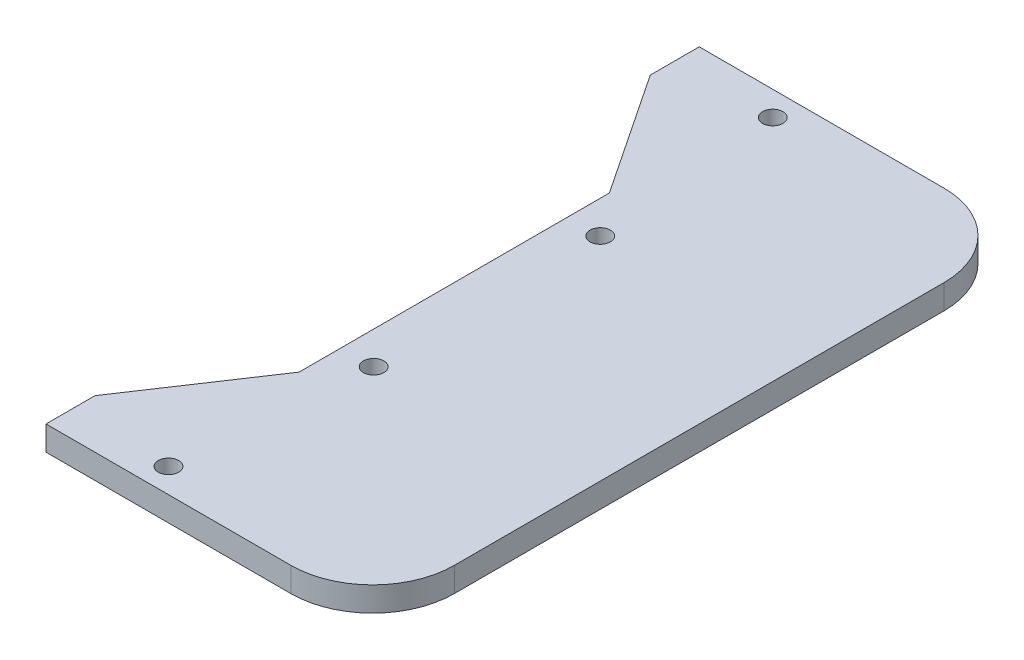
ISO-10303-21;
HEADER;
FILE_DESCRIPTION(('STEP AP214'),'2;1');
FILE_NAME('part.step','',(''),(''),'','','');
FILE_SCHEMA(('AUTOMOTIVE_DESIGN { 1 0 10303 214 1 1 1 1 }'));
ENDSEC;
DATA;
#1=APPLICATION_CONTEXT('core data for automotive mechanical design processes');
#2=APPLICATION_PROTOCOL_DEFINITION('international standard','automotive_design',2000,#1);
#3=PRODUCT_CONTEXT('',#1,'mechanical');
#4=PRODUCT('Part','Part','',(#3));
#5=PRODUCT_RELATED_PRODUCT_CATEGORY('part','',(#4));
#6=PRODUCT_DEFINITION_FORMATION('','',#4);
#7=PRODUCT_DEFINITION_CONTEXT('part definition',#1,'design');
#8=PRODUCT_DEFINITION('design','',#6,#7);
#9=PRODUCT_DEFINITION_SHAPE('','',#8);
#10=(LENGTH_UNIT() NAMED_UNIT(*) SI_UNIT(.MILLI.,.METRE.));
#11=(NAMED_UNIT(*) PLANE_ANGLE_UNIT() SI_UNIT($,.RADIAN.));
#12=(NAMED_UNIT(*) SI_UNIT($,.STERADIAN.) SOLID_ANGLE_UNIT());
#13=UNCERTAINTY_MEASURE_WITH_UNIT(LENGTH_MEASURE(1.E-05),#10,'distance_accuracy_value','');
#14=(GEOMETRIC_REPRESENTATION_CONTEXT(3) GLOBAL_UNCERTAINTY_ASSIGNED_CONTEXT((#13)) GLOBAL_UNIT_ASSIGNED_CONTEXT((#10,
#11,#12)) REPRESENTATION_CONTEXT('',''));
#15=CARTESIAN_POINT('',(0.,0.,0.));
#16=DIRECTION('',(0.,0.,1.));
#17=DIRECTION('',(1.,0.,0.));
#18=AXIS2_PLACEMENT_3D('',#15,#16,#17);
#19=CARTESIAN_POINT('',(20.,3.,30.));
#20=DIRECTION('',(0.,1.,0.));
#21=DIRECTION('',(0.,0.,1.));
#22=AXIS2_PLACEMENT_3D('',#19,#20,#21);
#23=PLANE('',#22);
#24=CARTESIAN_POINT('',(2.,3.,37.));
#25=DIRECTION('',(0.,1.,0.));
#26=DIRECTION('',(0.,0.,-1.));
#27=AXIS2_PLACEMENT_3D('',#24,#25,#26);
#28=CIRCLE('',#27,1.25);
#29=CARTESIAN_POINT('',(2.,3.,35.75));
#30=VERTEX_POINT('',#29);
#31=EDGE_CURVE('E226',#30,#30,#28,.T.);
#32=ORIENTED_EDGE('',*,*,#31,.F.);
#33=EDGE_LOOP('',(#32));
#34=FACE_BOUND('',#33,.T.);
#35=CARTESIAN_POINT('',(2.,3.,-37.));
#36=DIRECTION('',(0.,1.,0.));
#37=DIRECTION('',(0.,0.,1.));
#38=AXIS2_PLACEMENT_3D('',#35,#36,#37);
#39=CIRCLE('',#38,1.25);
#40=CARTESIAN_POINT('',(2.,3.,-35.75));
#41=VERTEX_POINT('',#40);
#42=EDGE_CURVE('E154',#41,#41,#39,.T.);
#43=ORIENTED_EDGE('',*,*,#42,.F.);
#44=EDGE_LOOP('',(#43));
#45=FACE_BOUND('',#44,.T.);
#46=DIRECTION('',(0.,0.,1.));
#47=VECTOR('',#46,1.);
#48=CARTESIAN_POINT('',(-10.,3.,-40.));
#49=LINE('',#48,#47);
#50=CARTESIAN_POINT('',(-10.,3.,-40.));
#51=VERTEX_POINT('',#50);
#52=CARTESIAN_POINT('',(-10.,3.,-34.));
#53=VERTEX_POINT('',#52);
#54=EDGE_CURVE('E169',#51,#53,#49,.T.);
#55=ORIENTED_EDGE('',*,*,#54,.T.);
#56=DIRECTION('',(0.554700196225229,0.,0.832050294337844));
#57=VECTOR('',#56,1.);
#58=CARTESIAN_POINT('',(-10.,3.,-34.));
#59=LINE('',#58,#57);
#60=CARTESIAN_POINT('',(0.,3.,-19.));
#61=VERTEX_POINT('',#60);
#62=EDGE_CURVE('E107',#53,#61,#59,.T.);
#63=ORIENTED_EDGE('',*,*,#62,.T.);
#64=DIRECTION('',(0.,0.,1.));
#65=VECTOR('',#64,1.);
#66=CARTESIAN_POINT('',(0.,3.,-19.));
#67=LINE('',#66,#65);
#68=CARTESIAN_POINT('',(0.,3.,19.));
#69=VERTEX_POINT('',#68);
#70=EDGE_CURVE('E190',#61,#69,#67,.T.);
#71=ORIENTED_EDGE('',*,*,#70,.T.);
#72=DIRECTION('',(-0.554700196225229,0.,0.832050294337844));
#73=VECTOR('',#72,1.);
#74=CARTESIAN_POINT('',(-10.,3.,34.));
#75=LINE('',#74,#73);
#76=CARTESIAN_POINT('',(-10.,3.,34.));
#77=VERTEX_POINT('',#76);
#78=EDGE_CURVE('E209',#69,#77,#75,.T.);
#79=ORIENTED_EDGE('',*,*,#78,.T.);
#80=DIRECTION('',(0.,0.,1.));
#81=VECTOR('',#80,1.);
#82=CARTESIAN_POINT('',(-10.,3.,40.));
#83=LINE('',#82,#81);
#84=CARTESIAN_POINT('',(-10.,3.,40.));
#85=VERTEX_POINT('',#84);
#86=EDGE_CURVE('E206',#77,#85,#83,.T.);
#87=ORIENTED_EDGE('',*,*,#86,.T.);
#88=DIRECTION('',(1.,0.,0.));
#89=VECTOR('',#88,1.);
#90=CARTESIAN_POINT('',(-10.,3.,40.));
#91=LINE('',#90,#89);
#92=CARTESIAN_POINT('',(19.9999999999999,3.,40.));
#93=VERTEX_POINT('',#92);
#94=EDGE_CURVE('E208',#85,#93,#91,.T.);
#95=ORIENTED_EDGE('',*,*,#94,.T.);
#96=CARTESIAN_POINT('',(20.,3.,30.));
#97=DIRECTION('',(0.,1.,0.));
#98=DIRECTION('',(0.,0.,1.));
#99=AXIS2_PLACEMENT_3D('',#96,#97,#98);
#100=CIRCLE('',#99,10.);
#101=CARTESIAN_POINT('',(30.,3.,29.9999999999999));
#102=VERTEX_POINT('',#101);
#103=EDGE_CURVE('E132',#93,#102,#100,.T.);
#104=ORIENTED_EDGE('',*,*,#103,.T.);
#105=DIRECTION('',(0.,0.,-1.));
#106=VECTOR('',#105,1.);
#107=CARTESIAN_POINT('',(30.,3.,-29.9999999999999));
#108=LINE('',#107,#106);
#109=CARTESIAN_POINT('',(30.,3.,-29.9999999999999));
#110=VERTEX_POINT('',#109);
#111=EDGE_CURVE('E126',#102,#110,#108,.T.);
#112=ORIENTED_EDGE('',*,*,#111,.T.);
#113=CARTESIAN_POINT('',(20.,3.,-30.));
#114=DIRECTION('',(0.,1.,0.));
#115=DIRECTION('',(0.,0.,-1.));
#116=AXIS2_PLACEMENT_3D('',#113,#114,#115);
#117=CIRCLE('',#116,10.);
#118=CARTESIAN_POINT('',(19.9999999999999,3.,-40.));
#119=VERTEX_POINT('',#118);
#120=EDGE_CURVE('E130',#110,#119,#117,.T.);
#121=ORIENTED_EDGE('',*,*,#120,.T.);
#122=DIRECTION('',(-1.,0.,0.));
#123=VECTOR('',#122,1.);
#124=CARTESIAN_POINT('',(-10.,3.,-40.));
#125=LINE('',#124,#123);
#126=EDGE_CURVE('E58',#119,#51,#125,.T.);
#127=ORIENTED_EDGE('',*,*,#126,.T.);
#128=EDGE_LOOP('',(#55,#63,#71,#79,#87,#95,#104,#112,#121,#127));
#129=FACE_BOUND('',#128,.T.);
#130=CARTESIAN_POINT('',(4.,3.,-13.87));
#131=DIRECTION('',(0.,1.,0.));
#132=DIRECTION('',(0.,0.,1.));
#133=AXIS2_PLACEMENT_3D('',#130,#131,#132);
#134=CIRCLE('',#133,1.25);
#135=CARTESIAN_POINT('',(4.,3.,-12.62));
#136=VERTEX_POINT('',#135);
#137=EDGE_CURVE('E220',#136,#136,#134,.T.);
#138=ORIENTED_EDGE('',*,*,#137,.F.);
#139=EDGE_LOOP('',(#138));
#140=FACE_BOUND('',#139,.T.);
#141=CARTESIAN_POINT('',(4.,3.,13.87));
#142=DIRECTION('',(0.,1.,0.));
#143=DIRECTION('',(0.,0.,-1.));
#144=AXIS2_PLACEMENT_3D('',#141,#142,#143);
#145=CIRCLE('',#144,1.25);
#146=CARTESIAN_POINT('',(4.,3.,12.62));
#147=VERTEX_POINT('',#146);
#148=EDGE_CURVE('E232',#147,#147,#145,.T.);
#149=ORIENTED_EDGE('',*,*,#148,.F.);
#150=EDGE_LOOP('',(#149));
#151=FACE_BOUND('',#150,.T.);
#152=ADVANCED_FACE('F41',(#34,#45,#129,#140,#151),#23,.T.);
#153=CARTESIAN_POINT('',(20.,0.,30.));
#154=DIRECTION('',(0.,1.,0.));
#155=DIRECTION('',(0.,0.,1.));
#156=AXIS2_PLACEMENT_3D('',#153,#154,#155);
#157=PLANE('',#156);
#158=DIRECTION('',(0.,0.,1.));
#159=VECTOR('',#158,1.);
#160=CARTESIAN_POINT('',(-10.,0.,-40.));
#161=LINE('',#160,#159);
#162=CARTESIAN_POINT('',(-10.,0.,-40.));
#163=VERTEX_POINT('',#162);
#164=CARTESIAN_POINT('',(-10.,0.,-34.));
#165=VERTEX_POINT('',#164);
#166=EDGE_CURVE('E150',#163,#165,#161,.T.);
#167=ORIENTED_EDGE('',*,*,#166,.F.);
#168=DIRECTION('',(-1.,0.,0.));
#169=VECTOR('',#168,1.);
#170=CARTESIAN_POINT('',(-10.,0.,-40.));
#171=LINE('',#170,#169);
#172=CARTESIAN_POINT('',(19.9999999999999,0.,-40.));
#173=VERTEX_POINT('',#172);
#174=EDGE_CURVE('E99',#173,#163,#171,.T.);
#175=ORIENTED_EDGE('',*,*,#174,.F.);
#176=CARTESIAN_POINT('',(20.,0.,-30.));
#177=DIRECTION('',(0.,1.,0.));
#178=DIRECTION('',(0.,0.,-1.));
#179=AXIS2_PLACEMENT_3D('',#176,#177,#178);
#180=CIRCLE('',#179,10.);
#181=CARTESIAN_POINT('',(30.,0.,-29.9999999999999));
#182=VERTEX_POINT('',#181);
#183=EDGE_CURVE('E93',#182,#173,#180,.T.);
#184=ORIENTED_EDGE('',*,*,#183,.F.);
#185=DIRECTION('',(0.,0.,-1.));
#186=VECTOR('',#185,1.);
#187=CARTESIAN_POINT('',(30.,0.,-29.9999999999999));
#188=LINE('',#187,#186);
#189=CARTESIAN_POINT('',(30.,0.,29.9999999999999));
#190=VERTEX_POINT('',#189);
#191=EDGE_CURVE('E140',#190,#182,#188,.T.);
#192=ORIENTED_EDGE('',*,*,#191,.F.);
#193=CARTESIAN_POINT('',(20.,0.,30.));
#194=DIRECTION('',(0.,1.,0.));
#195=DIRECTION('',(0.,0.,1.));
#196=AXIS2_PLACEMENT_3D('',#193,#194,#195);
#197=CIRCLE('',#196,10.);
#198=CARTESIAN_POINT('',(19.9999999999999,0.,40.));
#199=VERTEX_POINT('',#198);
#200=EDGE_CURVE('E164',#199,#190,#197,.T.);
#201=ORIENTED_EDGE('',*,*,#200,.F.);
#202=DIRECTION('',(1.,0.,0.));
#203=VECTOR('',#202,1.);
#204=CARTESIAN_POINT('',(-10.,0.,40.));
#205=LINE('',#204,#203);
#206=CARTESIAN_POINT('',(-10.,0.,40.));
#207=VERTEX_POINT('',#206);
#208=EDGE_CURVE('E162',#207,#199,#205,.T.);
#209=ORIENTED_EDGE('',*,*,#208,.F.);
#210=DIRECTION('',(0.,0.,1.));
#211=VECTOR('',#210,1.);
#212=CARTESIAN_POINT('',(-10.,0.,40.));
#213=LINE('',#212,#211);
#214=CARTESIAN_POINT('',(-10.,0.,34.));
#215=VERTEX_POINT('',#214);
#216=EDGE_CURVE('E160',#215,#207,#213,.T.);
#217=ORIENTED_EDGE('',*,*,#216,.F.);
#218=DIRECTION('',(-0.554700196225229,0.,0.832050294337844));
#219=VECTOR('',#218,1.);
#220=CARTESIAN_POINT('',(-10.,0.,34.));
#221=LINE('',#220,#219);
#222=CARTESIAN_POINT('',(0.,0.,19.));
#223=VERTEX_POINT('',#222);
#224=EDGE_CURVE('E158',#223,#215,#221,.T.);
#225=ORIENTED_EDGE('',*,*,#224,.F.);
#226=DIRECTION('',(0.,0.,1.));
#227=VECTOR('',#226,1.);
#228=CARTESIAN_POINT('',(0.,0.,-19.));
#229=LINE('',#228,#227);
#230=CARTESIAN_POINT('',(0.,0.,-19.));
#231=VERTEX_POINT('',#230);
#232=EDGE_CURVE('E156',#231,#223,#229,.T.);
#233=ORIENTED_EDGE('',*,*,#232,.F.);
#234=DIRECTION('',(0.554700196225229,0.,0.832050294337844));
#235=VECTOR('',#234,1.);
#236=CARTESIAN_POINT('',(-10.,0.,-34.));
#237=LINE('',#236,#235);
#238=EDGE_CURVE('E153',#165,#231,#237,.T.);
#239=ORIENTED_EDGE('',*,*,#238,.F.);
#240=EDGE_LOOP('',(#167,#175,#184,#192,#201,#209,#217,#225,#233,#239));
#241=FACE_BOUND('',#240,.T.);
#242=CARTESIAN_POINT('',(2.,0.,-37.));
#243=DIRECTION('',(0.,1.,0.));
#244=DIRECTION('',(0.,0.,1.));
#245=AXIS2_PLACEMENT_3D('',#242,#243,#244);
#246=CIRCLE('',#245,1.25);
#247=CARTESIAN_POINT('',(2.,0.,-35.75));
#248=VERTEX_POINT('',#247);
#249=EDGE_CURVE('E217',#248,#248,#246,.T.);
#250=ORIENTED_EDGE('',*,*,#249,.T.);
#251=EDGE_LOOP('',(#250));
#252=FACE_BOUND('',#251,.T.);
#253=CARTESIAN_POINT('',(4.,0.,-13.87));
#254=DIRECTION('',(0.,1.,0.));
#255=DIRECTION('',(0.,0.,1.));
#256=AXIS2_PLACEMENT_3D('',#253,#254,#255);
#257=CIRCLE('',#256,1.25);
#258=CARTESIAN_POINT('',(4.,0.,-12.62));
#259=VERTEX_POINT('',#258);
#260=EDGE_CURVE('E223',#259,#259,#257,.T.);
#261=ORIENTED_EDGE('',*,*,#260,.T.);
#262=EDGE_LOOP('',(#261));
#263=FACE_BOUND('',#262,.T.);
#264=CARTESIAN_POINT('',(2.,0.,37.));
#265=DIRECTION('',(0.,1.,0.));
#266=DIRECTION('',(0.,0.,-1.));
#267=AXIS2_PLACEMENT_3D('',#264,#265,#266);
#268=CIRCLE('',#267,1.25);
#269=CARTESIAN_POINT('',(2.,0.,35.75));
#270=VERTEX_POINT('',#269);
#271=EDGE_CURVE('E229',#270,#270,#268,.T.);
#272=ORIENTED_EDGE('',*,*,#271,.T.);
#273=EDGE_LOOP('',(#272));
#274=FACE_BOUND('',#273,.T.);
#275=CARTESIAN_POINT('',(4.,0.,13.87));
#276=DIRECTION('',(0.,1.,0.));
#277=DIRECTION('',(0.,0.,-1.));
#278=AXIS2_PLACEMENT_3D('',#275,#276,#277);
#279=CIRCLE('',#278,1.25);
#280=CARTESIAN_POINT('',(4.,0.,12.62));
#281=VERTEX_POINT('',#280);
#282=EDGE_CURVE('E235',#281,#281,#279,.T.);
#283=ORIENTED_EDGE('',*,*,#282,.T.);
#284=EDGE_LOOP('',(#283));
#285=FACE_BOUND('',#284,.T.);
#286=ADVANCED_FACE('F194',(#241,#252,#263,#274,#285),#157,.F.);
#287=CARTESIAN_POINT('',(-10.,3.,-40.));
#288=DIRECTION('',(1.,0.,0.));
#289=DIRECTION('',(0.,0.,-1.));
#290=AXIS2_PLACEMENT_3D('',#287,#288,#289);
#291=PLANE('',#290);
#292=ORIENTED_EDGE('',*,*,#166,.T.);
#293=DIRECTION('',(0.,-1.,0.));
#294=VECTOR('',#293,1.);
#295=CARTESIAN_POINT('',(-10.,3.,-34.));
#296=LINE('',#295,#294);
#297=EDGE_CURVE('E11',#53,#165,#296,.T.);
#298=ORIENTED_EDGE('',*,*,#297,.F.);
#299=ORIENTED_EDGE('',*,*,#54,.F.);
#300=DIRECTION('',(0.,-1.,0.));
#301=VECTOR('',#300,1.);
#302=CARTESIAN_POINT('',(-10.,3.,-40.));
#303=LINE('',#302,#301);
#304=EDGE_CURVE('E146',#51,#163,#303,.T.);
#305=ORIENTED_EDGE('',*,*,#304,.T.);
#306=EDGE_LOOP('',(#292,#298,#299,#305));
#307=FACE_BOUND('',#306,.T.);
#308=ADVANCED_FACE('F43',(#307),#291,.F.);
#309=CARTESIAN_POINT('',(-10.,3.,-34.));
#310=DIRECTION('',(0.832050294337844,0.,-0.554700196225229));
#311=DIRECTION('',(-0.554700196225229,0.,-0.832050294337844));
#312=AXIS2_PLACEMENT_3D('',#309,#310,#311);
#313=PLANE('',#312);
#314=ORIENTED_EDGE('',*,*,#238,.T.);
#315=DIRECTION('',(0.,-1.,0.));
#316=VECTOR('',#315,1.);
#317=CARTESIAN_POINT('',(0.,3.,-19.));
#318=LINE('',#317,#316);
#319=EDGE_CURVE('E50',#61,#231,#318,.T.);
#320=ORIENTED_EDGE('',*,*,#319,.F.);
#321=ORIENTED_EDGE('',*,*,#62,.F.);
#322=ORIENTED_EDGE('',*,*,#297,.T.);
#323=EDGE_LOOP('',(#314,#320,#321,#322));
#324=FACE_BOUND('',#323,.T.);
#325=ADVANCED_FACE('F277',(#324),#313,.F.);
#326=CARTESIAN_POINT('',(0.,3.,-19.));
#327=DIRECTION('',(1.,0.,0.));
#328=DIRECTION('',(0.,0.,-1.));
#329=AXIS2_PLACEMENT_3D('',#326,#327,#328);
#330=PLANE('',#329);
#331=ORIENTED_EDGE('',*,*,#232,.T.);
#332=DIRECTION('',(0.,-1.,0.));
#333=VECTOR('',#332,1.);
#334=CARTESIAN_POINT('',(0.,3.,19.));
#335=LINE('',#334,#333);
#336=EDGE_CURVE('E182',#69,#223,#335,.T.);
#337=ORIENTED_EDGE('',*,*,#336,.F.);
#338=ORIENTED_EDGE('',*,*,#70,.F.);
#339=ORIENTED_EDGE('',*,*,#319,.T.);
#340=EDGE_LOOP('',(#331,#337,#338,#339));
#341=FACE_BOUND('',#340,.T.);
#342=ADVANCED_FACE('F188',(#341),#330,.F.);
#343=CARTESIAN_POINT('',(-10.,3.,34.));
#344=DIRECTION('',(0.832050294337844,0.,0.554700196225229));
#345=DIRECTION('',(0.554700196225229,0.,-0.832050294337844));
#346=AXIS2_PLACEMENT_3D('',#343,#344,#345);
#347=PLANE('',#346);
#348=ORIENTED_EDGE('',*,*,#224,.T.);
#349=DIRECTION('',(0.,-1.,0.));
#350=VECTOR('',#349,1.);
#351=CARTESIAN_POINT('',(-10.,3.,34.));
#352=LINE('',#351,#350);
#353=EDGE_CURVE('E179',#77,#215,#352,.T.);
#354=ORIENTED_EDGE('',*,*,#353,.F.);
#355=ORIENTED_EDGE('',*,*,#78,.F.);
#356=ORIENTED_EDGE('',*,*,#336,.T.);
#357=EDGE_LOOP('',(#348,#354,#355,#356));
#358=FACE_BOUND('',#357,.T.);
#359=ADVANCED_FACE('F200',(#358),#347,.F.);
#360=CARTESIAN_POINT('',(-10.,3.,40.));
#361=DIRECTION('',(1.,0.,0.));
#362=DIRECTION('',(0.,0.,-1.));
#363=AXIS2_PLACEMENT_3D('',#360,#361,#362);
#364=PLANE('',#363);
#365=ORIENTED_EDGE('',*,*,#216,.T.);
#366=DIRECTION('',(0.,-1.,0.));
#367=VECTOR('',#366,1.);
#368=CARTESIAN_POINT('',(-10.,3.,40.));
#369=LINE('',#368,#367);
#370=EDGE_CURVE('E176',#85,#207,#369,.T.);
#371=ORIENTED_EDGE('',*,*,#370,.F.);
#372=ORIENTED_EDGE('',*,*,#86,.F.);
#373=ORIENTED_EDGE('',*,*,#353,.T.);
#374=EDGE_LOOP('',(#365,#371,#372,#373));
#375=FACE_BOUND('',#374,.T.);
#376=ADVANCED_FACE('F204',(#375),#364,.F.);
#377=CARTESIAN_POINT('',(-10.,3.,40.));
#378=DIRECTION('',(0.,0.,-1.));
#379=DIRECTION('',(-1.,0.,0.));
#380=AXIS2_PLACEMENT_3D('',#377,#378,#379);
#381=PLANE('',#380);
#382=ORIENTED_EDGE('',*,*,#208,.T.);
#383=DIRECTION('',(0.,-1.,0.));
#384=VECTOR('',#383,1.);
#385=CARTESIAN_POINT('',(19.9999999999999,3.,40.));
#386=LINE('',#385,#384);
#387=EDGE_CURVE('E173',#93,#199,#386,.T.);
#388=ORIENTED_EDGE('',*,*,#387,.F.);
#389=ORIENTED_EDGE('',*,*,#94,.F.);
#390=ORIENTED_EDGE('',*,*,#370,.T.);
#391=EDGE_LOOP('',(#382,#388,#389,#390));
#392=FACE_BOUND('',#391,.T.);
#393=ADVANCED_FACE('F267',(#392),#381,.F.);
#394=CARTESIAN_POINT('',(20.,3.,30.));
#395=DIRECTION('',(0.,-1.,0.));
#396=DIRECTION('',(0.,0.,-1.));
#397=AXIS2_PLACEMENT_3D('',#394,#395,#396);
#398=CYLINDRICAL_SURFACE('',#397,10.);
#399=ORIENTED_EDGE('',*,*,#200,.T.);
#400=DIRECTION('',(0.,-1.,0.));
#401=VECTOR('',#400,1.);
#402=CARTESIAN_POINT('',(30.,3.,29.9999999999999));
#403=LINE('',#402,#401);
#404=EDGE_CURVE('E141',#102,#190,#403,.T.);
#405=ORIENTED_EDGE('',*,*,#404,.F.);
#406=ORIENTED_EDGE('',*,*,#103,.F.);
#407=ORIENTED_EDGE('',*,*,#387,.T.);
#408=EDGE_LOOP('',(#399,#405,#406,#407));
#409=FACE_BOUND('',#408,.T.);
#410=ADVANCED_FACE('F264',(#409),#398,.T.);
#411=CARTESIAN_POINT('',(30.,3.,-29.9999999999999));
#412=DIRECTION('',(-1.,0.,0.));
#413=DIRECTION('',(0.,0.,1.));
#414=AXIS2_PLACEMENT_3D('',#411,#412,#413);
#415=PLANE('',#414);
#416=ORIENTED_EDGE('',*,*,#191,.T.);
#417=DIRECTION('',(0.,-1.,0.));
#418=VECTOR('',#417,1.);
#419=CARTESIAN_POINT('',(30.,3.,-29.9999999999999));
#420=LINE('',#419,#418);
#421=EDGE_CURVE('E137',#110,#182,#420,.T.);
#422=ORIENTED_EDGE('',*,*,#421,.F.);
#423=ORIENTED_EDGE('',*,*,#111,.F.);
#424=ORIENTED_EDGE('',*,*,#404,.T.);
#425=EDGE_LOOP('',(#416,#422,#423,#424));
#426=FACE_BOUND('',#425,.T.);
#427=ADVANCED_FACE('F138',(#426),#415,.F.);
#428=CARTESIAN_POINT('',(20.,3.,-30.));
#429=DIRECTION('',(0.,-1.,0.));
#430=DIRECTION('',(0.,0.,-1.));
#431=AXIS2_PLACEMENT_3D('',#428,#429,#430);
#432=CYLINDRICAL_SURFACE('',#431,10.);
#433=ORIENTED_EDGE('',*,*,#183,.T.);
#434=DIRECTION('',(0.,-1.,0.));
#435=VECTOR('',#434,1.);
#436=CARTESIAN_POINT('',(19.9999999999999,3.,-40.));
#437=LINE('',#436,#435);
#438=EDGE_CURVE('E142',#119,#173,#437,.T.);
#439=ORIENTED_EDGE('',*,*,#438,.F.);
#440=ORIENTED_EDGE('',*,*,#120,.F.);
#441=ORIENTED_EDGE('',*,*,#421,.T.);
#442=EDGE_LOOP('',(#433,#439,#440,#441));
#443=FACE_BOUND('',#442,.T.);
#444=ADVANCED_FACE('F144',(#443),#432,.T.);
#445=CARTESIAN_POINT('',(-10.,3.,-40.));
#446=DIRECTION('',(0.,0.,1.));
#447=DIRECTION('',(1.,0.,0.));
#448=AXIS2_PLACEMENT_3D('',#445,#446,#447);
#449=PLANE('',#448);
#450=ORIENTED_EDGE('',*,*,#174,.T.);
#451=ORIENTED_EDGE('',*,*,#304,.F.);
#452=ORIENTED_EDGE('',*,*,#126,.F.);
#453=ORIENTED_EDGE('',*,*,#438,.T.);
#454=EDGE_LOOP('',(#450,#451,#452,#453));
#455=FACE_BOUND('',#454,.T.);
#456=ADVANCED_FACE('F257',(#455),#449,.F.);
#457=CARTESIAN_POINT('',(2.,3.,-37.));
#458=DIRECTION('',(0.,-1.,0.));
#459=DIRECTION('',(0.,0.,-1.));
#460=AXIS2_PLACEMENT_3D('',#457,#458,#459);
#461=CYLINDRICAL_SURFACE('',#460,1.25);
#462=ORIENTED_EDGE('',*,*,#42,.T.);
#463=EDGE_LOOP('',(#462));
#464=FACE_BOUND('',#463,.T.);
#465=ORIENTED_EDGE('',*,*,#249,.F.);
#466=EDGE_LOOP('',(#465));
#467=FACE_BOUND('',#466,.T.);
#468=ADVANCED_FACE('F254',(#464,#467),#461,.F.);
#469=CARTESIAN_POINT('',(4.,3.,-13.87));
#470=DIRECTION('',(0.,-1.,0.));
#471=DIRECTION('',(0.,0.,-1.));
#472=AXIS2_PLACEMENT_3D('',#469,#470,#471);
#473=CYLINDRICAL_SURFACE('',#472,1.25);
#474=ORIENTED_EDGE('',*,*,#137,.T.);
#475=EDGE_LOOP('',(#474));
#476=FACE_BOUND('',#475,.T.);
#477=ORIENTED_EDGE('',*,*,#260,.F.);
#478=EDGE_LOOP('',(#477));
#479=FACE_BOUND('',#478,.T.);
#480=ADVANCED_FACE('F367',(#476,#479),#473,.F.);
#481=CARTESIAN_POINT('',(2.,3.,37.));
#482=DIRECTION('',(0.,-1.,0.));
#483=DIRECTION('',(0.,0.,-1.));
#484=AXIS2_PLACEMENT_3D('',#481,#482,#483);
#485=CYLINDRICAL_SURFACE('',#484,1.25);
#486=ORIENTED_EDGE('',*,*,#31,.T.);
#487=EDGE_LOOP('',(#486));
#488=FACE_BOUND('',#487,.T.);
#489=ORIENTED_EDGE('',*,*,#271,.F.);
#490=EDGE_LOOP('',(#489));
#491=FACE_BOUND('',#490,.T.);
#492=ADVANCED_FACE('F376',(#488,#491),#485,.F.);
#493=CARTESIAN_POINT('',(4.,3.,13.87));
#494=DIRECTION('',(0.,-1.,0.));
#495=DIRECTION('',(0.,0.,-1.));
#496=AXIS2_PLACEMENT_3D('',#493,#494,#495);
#497=CYLINDRICAL_SURFACE('',#496,1.25);
#498=ORIENTED_EDGE('',*,*,#148,.T.);
#499=EDGE_LOOP('',(#498));
#500=FACE_BOUND('',#499,.T.);
#501=ORIENTED_EDGE('',*,*,#282,.F.);
#502=EDGE_LOOP('',(#501));
#503=FACE_BOUND('',#502,.T.);
#504=ADVANCED_FACE('F241',(#500,#503),#497,.F.);
#505=CLOSED_SHELL('',(#152,#286,#308,#325,#342,#359,#376,#393,#410,#427,#444,#456,#468,#480,
#492,#504));
#506=MANIFOLD_SOLID_BREP('B2',#505);
#507=ADVANCED_BREP_SHAPE_REPRESENTATION('',(#18,#506),#14);
#508=SHAPE_DEFINITION_REPRESENTATION(#9,#507);
ENDSEC;
END-ISO-10303-21;
